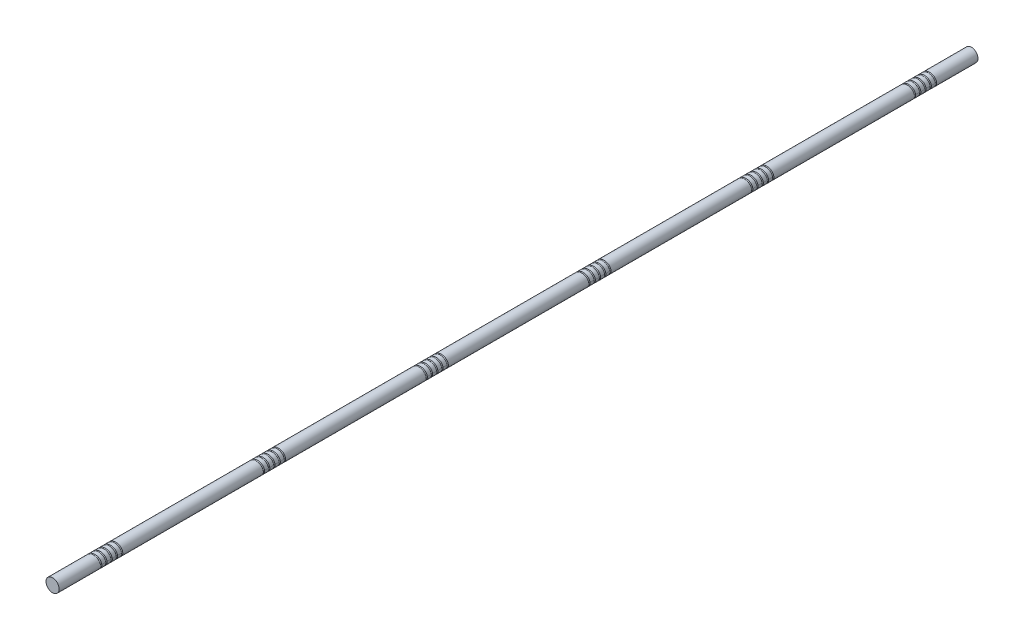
from build123d import *

# Parameters (mm, degrees)
SKETCH1_R              = 25
BOSS_EXTRUDE1_DEPTH    = 3500
CUT_SWEEP1_PITCH       = 20
CUT_SWEEP1_HEIGHT      = 100
CUT_SWEEP1_RADIUS      = 27.116666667
CUT_SWEEP1_START_ANGLE = -180
SKETCH3_R              = 3.175
LPATTERN1_COUNT        = 6
LPATTERN1_PITCH        = 620


with BuildPart() as part:
    # Sketch1 → Boss-Extrude1 (new body)
    with BuildSketch(Plane.XY):
        Circle(SKETCH1_R)
    extrude(amount=BOSS_EXTRUDE1_DEPTH)

    # Cut-Sweep1: sweep along a helix
    with BuildLine() as cut_sweep1_path:
        add(Helix(CUT_SWEEP1_PITCH, CUT_SWEEP1_HEIGHT, CUT_SWEEP1_RADIUS, center=(0, 0, 150), direction=(0, 0, 1), mode=Mode.PRIVATE).rotate(Axis((0, 0, 150), (0, 0, 1)), CUT_SWEEP1_START_ANGLE))
    # Sketch3 → Cut-Sweep1 (sweep, cut)
    with BuildSketch(Plane(origin=(0, 0, 0), x_dir=(1, 0, 0), z_dir=(0, 1, 0))):
        with Locations((-27.116666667, -150)):
            Circle(SKETCH3_R)
    cut_sweep1 = sweep(path=cut_sweep1_path.line, is_frenet=True, mode=Mode.SUBTRACT)

    # LPattern1: Cut-Sweep1 ×6
    with Locations(*[(0, 0, i * LPATTERN1_PITCH) for i in range(1, LPATTERN1_COUNT)]):
        add(cut_sweep1, mode=Mode.SUBTRACT)


solid = part.part
